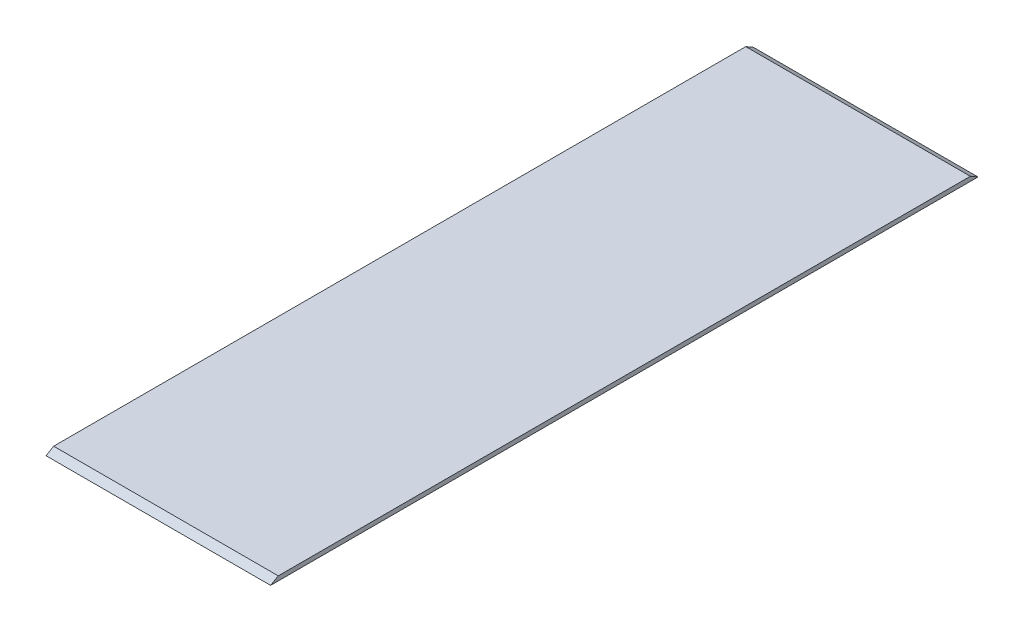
ISO-10303-21;
HEADER;
FILE_DESCRIPTION(('STEP AP214'),'2;1');
FILE_NAME('part.step','',(''),(''),'','','');
FILE_SCHEMA(('AUTOMOTIVE_DESIGN { 1 0 10303 214 1 1 1 1 }'));
ENDSEC;
DATA;
#1=APPLICATION_CONTEXT('core data for automotive mechanical design processes');
#2=APPLICATION_PROTOCOL_DEFINITION('international standard','automotive_design',2000,#1);
#3=PRODUCT_CONTEXT('',#1,'mechanical');
#4=PRODUCT('Part','Part','',(#3));
#5=PRODUCT_RELATED_PRODUCT_CATEGORY('part','',(#4));
#6=PRODUCT_DEFINITION_FORMATION('','',#4);
#7=PRODUCT_DEFINITION_CONTEXT('part definition',#1,'design');
#8=PRODUCT_DEFINITION('design','',#6,#7);
#9=PRODUCT_DEFINITION_SHAPE('','',#8);
#10=(LENGTH_UNIT() NAMED_UNIT(*) SI_UNIT(.MILLI.,.METRE.));
#11=(NAMED_UNIT(*) PLANE_ANGLE_UNIT() SI_UNIT($,.RADIAN.));
#12=(NAMED_UNIT(*) SI_UNIT($,.STERADIAN.) SOLID_ANGLE_UNIT());
#13=UNCERTAINTY_MEASURE_WITH_UNIT(LENGTH_MEASURE(1.E-05),#10,'distance_accuracy_value','');
#14=(GEOMETRIC_REPRESENTATION_CONTEXT(3) GLOBAL_UNCERTAINTY_ASSIGNED_CONTEXT((#13)) GLOBAL_UNIT_ASSIGNED_CONTEXT((#10,
#11,#12)) REPRESENTATION_CONTEXT('',''));
#15=CARTESIAN_POINT('',(0.,0.,0.));
#16=DIRECTION('',(0.,0.,1.));
#17=DIRECTION('',(1.,0.,0.));
#18=AXIS2_PLACEMENT_3D('',#15,#16,#17);
#19=CARTESIAN_POINT('',(322.58,6.35,1016.));
#20=DIRECTION('',(-1.,0.,0.));
#21=DIRECTION('',(0.,0.,1.));
#22=AXIS2_PLACEMENT_3D('',#19,#20,#21);
#23=PLANE('',#22);
#24=DIRECTION('',(0.,0.,-1.));
#25=VECTOR('',#24,1.);
#26=CARTESIAN_POINT('',(322.58,-6.35,1016.));
#27=LINE('',#26,#25);
#28=CARTESIAN_POINT('',(322.58,-6.35,1016.));
#29=VERTEX_POINT('',#28);
#30=CARTESIAN_POINT('',(322.58,-6.35,-1016.));
#31=VERTEX_POINT('',#30);
#32=EDGE_CURVE('E91',#29,#31,#27,.T.);
#33=ORIENTED_EDGE('',*,*,#32,.T.);
#34=DIRECTION('',(0.,-0.500000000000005,-0.866025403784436));
#35=VECTOR('',#34,1.);
#36=CARTESIAN_POINT('',(322.58,-249.283633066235,-1436.77339533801));
#37=LINE('',#36,#35);
#38=CARTESIAN_POINT('',(322.58,6.34999999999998,-994.002954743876));
#39=VERTEX_POINT('',#38);
#40=EDGE_CURVE('E54',#39,#31,#37,.T.);
#41=ORIENTED_EDGE('',*,*,#40,.F.);
#42=DIRECTION('',(0.,0.,-1.));
#43=VECTOR('',#42,1.);
#44=CARTESIAN_POINT('',(322.58,6.35,1016.));
#45=LINE('',#44,#43);
#46=CARTESIAN_POINT('',(322.58,6.35000000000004,994.002954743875));
#47=VERTEX_POINT('',#46);
#48=EDGE_CURVE('E38',#47,#39,#45,.T.);
#49=ORIENTED_EDGE('',*,*,#48,.F.);
#50=DIRECTION('',(0.,0.500000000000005,-0.866025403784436));
#51=VECTOR('',#50,1.);
#52=CARTESIAN_POINT('',(322.58,1119.64044331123,-934.27265665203));
#53=LINE('',#52,#51);
#54=EDGE_CURVE('E84',#29,#47,#53,.T.);
#55=ORIENTED_EDGE('',*,*,#54,.F.);
#56=EDGE_LOOP('',(#33,#41,#49,#55));
#57=FACE_BOUND('',#56,.T.);
#58=ADVANCED_FACE('F30',(#57),#23,.F.);
#59=CARTESIAN_POINT('',(-322.58,6.35,1016.));
#60=DIRECTION('',(1.,0.,0.));
#61=DIRECTION('',(0.,0.,-1.));
#62=AXIS2_PLACEMENT_3D('',#59,#60,#61);
#63=PLANE('',#62);
#64=DIRECTION('',(0.,0.,1.));
#65=VECTOR('',#64,1.);
#66=CARTESIAN_POINT('',(-322.58,6.35,1016.));
#67=LINE('',#66,#65);
#68=CARTESIAN_POINT('',(-322.58,6.34999999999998,-994.002954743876));
#69=VERTEX_POINT('',#68);
#70=CARTESIAN_POINT('',(-322.58,6.35000000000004,994.002954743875));
#71=VERTEX_POINT('',#70);
#72=EDGE_CURVE('E11',#69,#71,#67,.T.);
#73=ORIENTED_EDGE('',*,*,#72,.F.);
#74=DIRECTION('',(0.,-0.500000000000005,-0.866025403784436));
#75=VECTOR('',#74,1.);
#76=CARTESIAN_POINT('',(-322.58,-249.283633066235,-1436.77339533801));
#77=LINE('',#76,#75);
#78=CARTESIAN_POINT('',(-322.58,-6.35,-1016.));
#79=VERTEX_POINT('',#78);
#80=EDGE_CURVE('E70',#69,#79,#77,.T.);
#81=ORIENTED_EDGE('',*,*,#80,.T.);
#82=DIRECTION('',(0.,0.,1.));
#83=VECTOR('',#82,1.);
#84=CARTESIAN_POINT('',(-322.58,-6.35,1016.));
#85=LINE('',#84,#83);
#86=CARTESIAN_POINT('',(-322.58,-6.35,1016.));
#87=VERTEX_POINT('',#86);
#88=EDGE_CURVE('E87',#79,#87,#85,.T.);
#89=ORIENTED_EDGE('',*,*,#88,.T.);
#90=DIRECTION('',(0.,0.500000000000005,-0.866025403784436));
#91=VECTOR('',#90,1.);
#92=CARTESIAN_POINT('',(-322.58,1119.64044331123,-934.27265665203));
#93=LINE('',#92,#91);
#94=EDGE_CURVE('E46',#87,#71,#93,.T.);
#95=ORIENTED_EDGE('',*,*,#94,.T.);
#96=EDGE_LOOP('',(#73,#81,#89,#95));
#97=FACE_BOUND('',#96,.T.);
#98=ADVANCED_FACE('F86',(#97),#63,.F.);
#99=CARTESIAN_POINT('',(322.58,6.35,-1016.));
#100=DIRECTION('',(0.,-1.,0.));
#101=DIRECTION('',(0.,0.,-1.));
#102=AXIS2_PLACEMENT_3D('',#99,#100,#101);
#103=PLANE('',#102);
#104=ORIENTED_EDGE('',*,*,#48,.T.);
#105=DIRECTION('',(1.,0.,0.));
#106=VECTOR('',#105,1.);
#107=CARTESIAN_POINT('',(-322.58,6.34999999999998,-994.002954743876));
#108=LINE('',#107,#106);
#109=EDGE_CURVE('E73',#69,#39,#108,.T.);
#110=ORIENTED_EDGE('',*,*,#109,.F.);
#111=ORIENTED_EDGE('',*,*,#72,.T.);
#112=DIRECTION('',(1.,0.,0.));
#113=VECTOR('',#112,1.);
#114=CARTESIAN_POINT('',(-322.58,6.35000000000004,994.002954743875));
#115=LINE('',#114,#113);
#116=EDGE_CURVE('E89',#71,#47,#115,.T.);
#117=ORIENTED_EDGE('',*,*,#116,.T.);
#118=EDGE_LOOP('',(#104,#110,#111,#117));
#119=FACE_BOUND('',#118,.T.);
#120=ADVANCED_FACE('F81',(#119),#103,.F.);
#121=CARTESIAN_POINT('',(322.58,-6.35,-1016.));
#122=DIRECTION('',(0.,-1.,0.));
#123=DIRECTION('',(0.,0.,-1.));
#124=AXIS2_PLACEMENT_3D('',#121,#122,#123);
#125=PLANE('',#124);
#126=ORIENTED_EDGE('',*,*,#32,.F.);
#127=DIRECTION('',(1.,0.,0.));
#128=VECTOR('',#127,1.);
#129=CARTESIAN_POINT('',(-322.58,-6.35,1016.));
#130=LINE('',#129,#128);
#131=EDGE_CURVE('E33',#87,#29,#130,.T.);
#132=ORIENTED_EDGE('',*,*,#131,.F.);
#133=ORIENTED_EDGE('',*,*,#88,.F.);
#134=DIRECTION('',(-1.,0.,0.));
#135=VECTOR('',#134,1.);
#136=CARTESIAN_POINT('',(-322.58,-6.35,-1016.));
#137=LINE('',#136,#135);
#138=EDGE_CURVE('E74',#31,#79,#137,.T.);
#139=ORIENTED_EDGE('',*,*,#138,.F.);
#140=EDGE_LOOP('',(#126,#132,#133,#139));
#141=FACE_BOUND('',#140,.T.);
#142=ADVANCED_FACE('F104',(#141),#125,.T.);
#143=CARTESIAN_POINT('',(-322.58,1119.64044331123,-934.27265665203));
#144=DIRECTION('',(0.,-0.866025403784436,-0.500000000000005));
#145=DIRECTION('',(0.,0.500000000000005,-0.866025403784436));
#146=AXIS2_PLACEMENT_3D('',#143,#144,#145);
#147=PLANE('',#146);
#148=ORIENTED_EDGE('',*,*,#54,.T.);
#149=ORIENTED_EDGE('',*,*,#116,.F.);
#150=ORIENTED_EDGE('',*,*,#94,.F.);
#151=ORIENTED_EDGE('',*,*,#131,.T.);
#152=EDGE_LOOP('',(#148,#149,#150,#151));
#153=FACE_BOUND('',#152,.T.);
#154=ADVANCED_FACE('F100',(#153),#147,.F.);
#155=CARTESIAN_POINT('',(-322.58,-249.283633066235,-1436.77339533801));
#156=DIRECTION('',(0.,-0.866025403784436,0.500000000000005));
#157=DIRECTION('',(0.,-0.500000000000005,-0.866025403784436));
#158=AXIS2_PLACEMENT_3D('',#155,#156,#157);
#159=PLANE('',#158);
#160=ORIENTED_EDGE('',*,*,#40,.T.);
#161=ORIENTED_EDGE('',*,*,#138,.T.);
#162=ORIENTED_EDGE('',*,*,#80,.F.);
#163=ORIENTED_EDGE('',*,*,#109,.T.);
#164=EDGE_LOOP('',(#160,#161,#162,#163));
#165=FACE_BOUND('',#164,.T.);
#166=ADVANCED_FACE('F72',(#165),#159,.F.);
#167=CLOSED_SHELL('',(#58,#98,#120,#142,#154,#166));
#168=MANIFOLD_SOLID_BREP('B2',#167);
#169=ADVANCED_BREP_SHAPE_REPRESENTATION('',(#18,#168),#14);
#170=SHAPE_DEFINITION_REPRESENTATION(#9,#169);
ENDSEC;
END-ISO-10303-21;
